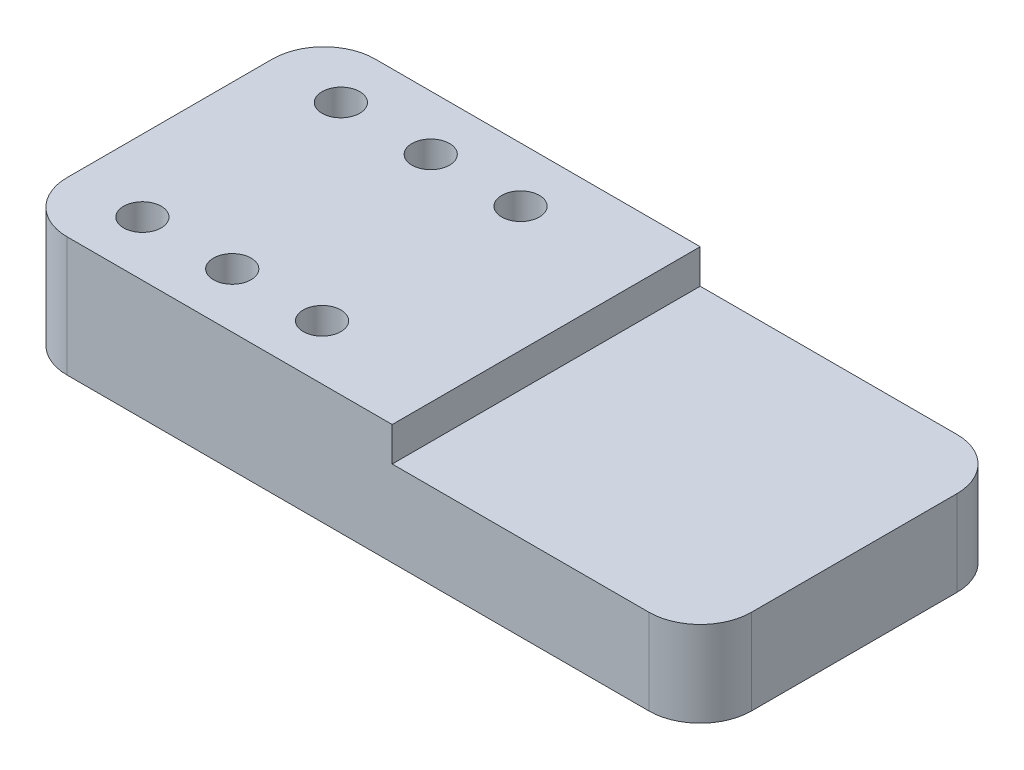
from build123d import *

# Parameters (mm, degrees)
BOSS_EXTRUDE1_DEPTH        = 90
FILLET1_R                  = 29.999999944
M24X2_0_TAPPED_HOLE1_D     = 22
M24X2_0_TAPPED_HOLE1_DEPTH = 55.118


with BuildPart() as part:
    # Sketch1 → Boss-Extrude1 (new, symmetric)
    with BuildSketch(Plane.XY):
        Polygon((-200, 70), (20, 70), (20, 50), (200, 50), (200, 0), (-200, 0), align=None)
    extrude(amount=BOSS_EXTRUDE1_DEPTH, both=True)

    # Fillet1
    fillet1_edges = [part.edges().sort_by_distance(p)[0] for p in [
        (200, 25, 90),
        (-200, 35, 90),
        (200, 25, -90),
        (-200, 35, -90),
    ]]
    fillet(fillet1_edges, radius=FILLET1_R)

    # M24x2.0 Tapped Hole1
    with Locations(Plane(origin=(0, 70, 0), x_dir=(1, 0, 0), z_dir=(0, 1, 0))):
        with Locations((-158, 58), (-105.5, 58), (-53, 58), (-158, -58), (-53, -58), (-105.5, -58)):
            Hole(M24X2_0_TAPPED_HOLE1_D / 2, depth=M24X2_0_TAPPED_HOLE1_DEPTH)


solid = part.part
